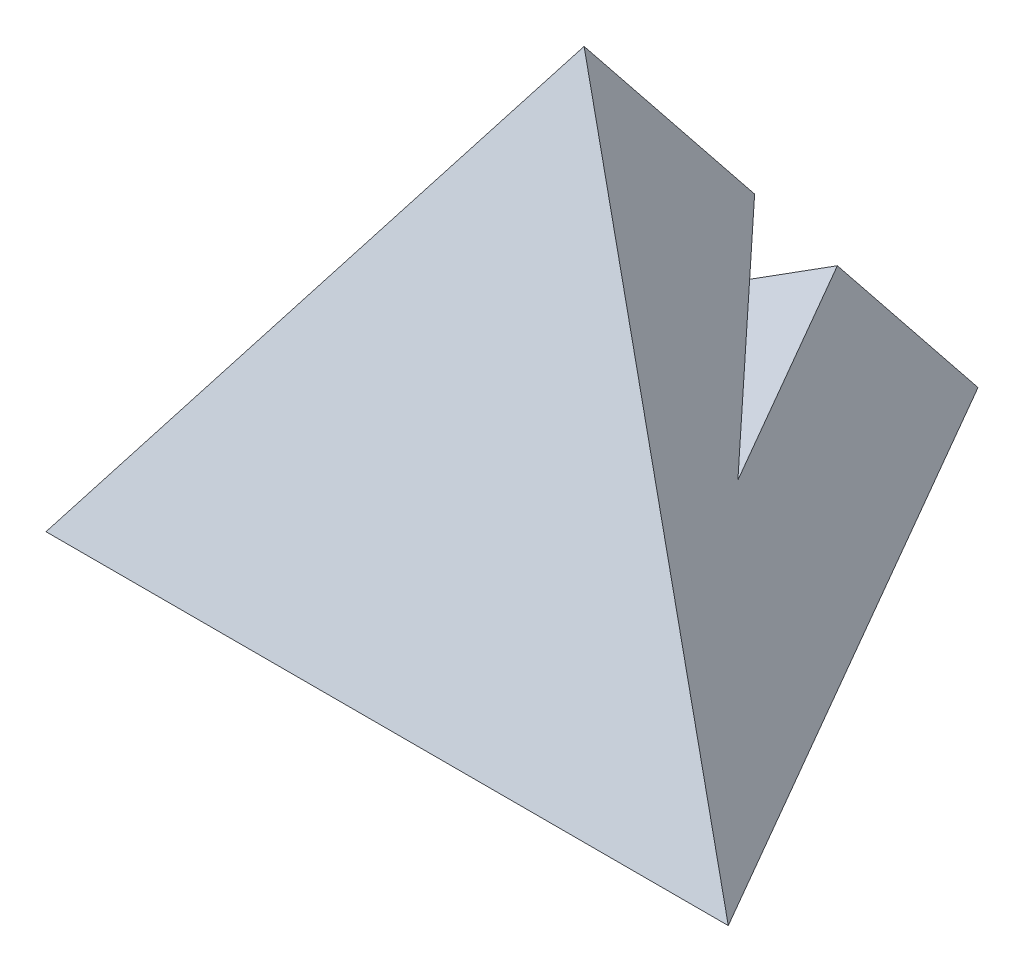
ISO-10303-21;
HEADER;
FILE_DESCRIPTION(('STEP AP214'),'2;1');
FILE_NAME('part.step','',(''),(''),'','','');
FILE_SCHEMA(('AUTOMOTIVE_DESIGN { 1 0 10303 214 1 1 1 1 }'));
ENDSEC;
DATA;
#1=APPLICATION_CONTEXT('core data for automotive mechanical design processes');
#2=APPLICATION_PROTOCOL_DEFINITION('international standard','automotive_design',2000,#1);
#3=PRODUCT_CONTEXT('',#1,'mechanical');
#4=PRODUCT('Part','Part','',(#3));
#5=PRODUCT_RELATED_PRODUCT_CATEGORY('part','',(#4));
#6=PRODUCT_DEFINITION_FORMATION('','',#4);
#7=PRODUCT_DEFINITION_CONTEXT('part definition',#1,'design');
#8=PRODUCT_DEFINITION('design','',#6,#7);
#9=PRODUCT_DEFINITION_SHAPE('','',#8);
#10=(LENGTH_UNIT() NAMED_UNIT(*) SI_UNIT(.MILLI.,.METRE.));
#11=(NAMED_UNIT(*) PLANE_ANGLE_UNIT() SI_UNIT($,.RADIAN.));
#12=(NAMED_UNIT(*) SI_UNIT($,.STERADIAN.) SOLID_ANGLE_UNIT());
#13=UNCERTAINTY_MEASURE_WITH_UNIT(LENGTH_MEASURE(1.E-05),#10,'distance_accuracy_value','');
#14=(GEOMETRIC_REPRESENTATION_CONTEXT(3) GLOBAL_UNCERTAINTY_ASSIGNED_CONTEXT((#13)) GLOBAL_UNIT_ASSIGNED_CONTEXT((#10,
#11,#12)) REPRESENTATION_CONTEXT('',''));
#15=CARTESIAN_POINT('',(0.,0.,0.));
#16=DIRECTION('',(0.,0.,1.));
#17=DIRECTION('',(1.,0.,0.));
#18=AXIS2_PLACEMENT_3D('',#15,#16,#17);
#19=CARTESIAN_POINT('',(0.,0.,0.));
#20=DIRECTION('',(0.,1.,0.));
#21=DIRECTION('',(0.,0.,1.));
#22=AXIS2_PLACEMENT_3D('',#19,#20,#21);
#23=PLANE('',#22);
#24=DIRECTION('',(-0.500000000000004,0.,-0.866025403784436));
#25=VECTOR('',#24,1.);
#26=CARTESIAN_POINT('',(1319.82271536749,0.,761.999999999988));
#27=LINE('',#26,#25);
#28=CARTESIAN_POINT('',(1319.82271536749,0.,761.999999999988));
#29=VERTEX_POINT('',#28);
#30=CARTESIAN_POINT('',(0.,0.,-1524.));
#31=VERTEX_POINT('',#30);
#32=EDGE_CURVE('E98',#29,#31,#27,.T.);
#33=ORIENTED_EDGE('',*,*,#32,.F.);
#34=DIRECTION('',(1.,0.,0.));
#35=VECTOR('',#34,1.);
#36=CARTESIAN_POINT('',(-1319.82271536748,0.,762.000000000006));
#37=LINE('',#36,#35);
#38=CARTESIAN_POINT('',(-1319.82271536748,0.,762.000000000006));
#39=VERTEX_POINT('',#38);
#40=EDGE_CURVE('E112',#39,#29,#37,.T.);
#41=ORIENTED_EDGE('',*,*,#40,.F.);
#42=DIRECTION('',(-0.499999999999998,0.,0.86602540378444));
#43=VECTOR('',#42,1.);
#44=CARTESIAN_POINT('',(0.,0.,-1524.));
#45=LINE('',#44,#43);
#46=EDGE_CURVE('E167',#31,#39,#45,.T.);
#47=ORIENTED_EDGE('',*,*,#46,.F.);
#48=EDGE_LOOP('',(#33,#41,#47));
#49=FACE_BOUND('',#48,.T.);
#50=ADVANCED_FACE('F48',(#49),#23,.F.);
#51=CARTESIAN_POINT('',(-568.889101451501,262.758620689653,-328.448275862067));
#52=DIRECTION('',(-0.804084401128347,0.371390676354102,-0.464238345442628));
#53=DIRECTION('',(-0.499999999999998,0.,0.86602540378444));
#54=AXIS2_PLACEMENT_3D('',#51,#52,#53);
#55=PLANE('',#54);
#56=DIRECTION('',(-0.499999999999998,0.,0.86602540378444));
#57=VECTOR('',#56,1.);
#58=CARTESIAN_POINT('',(-424.308091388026,680.12804608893,-244.974390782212));
#59=LINE('',#58,#57);
#60=CARTESIAN_POINT('',(0.,680.12804608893,-979.897563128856));
#61=VERTEX_POINT('',#60);
#62=CARTESIAN_POINT('',(-525.775102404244,680.12804608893,-69.2283724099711));
#63=VERTEX_POINT('',#62);
#64=EDGE_CURVE('E91',#61,#63,#59,.T.);
#65=ORIENTED_EDGE('',*,*,#64,.F.);
#66=DIRECTION('',(0.,-0.78086880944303,-0.624695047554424));
#67=VECTOR('',#66,1.);
#68=CARTESIAN_POINT('',(0.,1905.,0.));
#69=LINE('',#68,#67);
#70=EDGE_CURVE('E147',#61,#31,#69,.T.);
#71=ORIENTED_EDGE('',*,*,#70,.T.);
#72=ORIENTED_EDGE('',*,*,#46,.T.);
#73=DIRECTION('',(-0.541001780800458,-0.78086880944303,0.312347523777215));
#74=VECTOR('',#73,1.);
#75=CARTESIAN_POINT('',(0.,1905.,0.));
#76=LINE('',#75,#74);
#77=CARTESIAN_POINT('',(0.,1905.,0.));
#78=VERTEX_POINT('',#77);
#79=EDGE_CURVE('E117',#78,#39,#76,.T.);
#80=ORIENTED_EDGE('',*,*,#79,.F.);
#81=CARTESIAN_POINT('',(0.,1080.25308130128,-659.797534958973));
#82=VERTEX_POINT('',#81);
#83=EDGE_CURVE('E72',#78,#82,#69,.T.);
#84=ORIENTED_EDGE('',*,*,#83,.T.);
#85=DIRECTION('',(0.59330643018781,0.451517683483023,-0.666422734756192));
#86=VECTOR('',#85,1.);
#87=CARTESIAN_POINT('',(-550.266466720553,661.489643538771,-41.7188071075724));
#88=LINE('',#87,#86);
#89=EDGE_CURVE('E65',#63,#82,#88,.T.);
#90=ORIENTED_EDGE('',*,*,#89,.F.);
#91=EDGE_LOOP('',(#65,#71,#72,#80,#84,#90));
#92=FACE_BOUND('',#91,.T.);
#93=ADVANCED_FACE('F103',(#92),#55,.T.);
#94=CARTESIAN_POINT('',(4.55326481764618E-12,262.758620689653,656.896551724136));
#95=DIRECTION('',(0.,0.371390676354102,0.92847669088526));
#96=DIRECTION('',(0.,-0.92847669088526,0.371390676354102));
#97=AXIS2_PLACEMENT_3D('',#94,#95,#96);
#98=PLANE('',#97);
#99=ORIENTED_EDGE('',*,*,#79,.T.);
#100=ORIENTED_EDGE('',*,*,#40,.T.);
#101=DIRECTION('',(0.541001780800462,-0.78086880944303,0.312347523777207));
#102=VECTOR('',#101,1.);
#103=CARTESIAN_POINT('',(0.,1905.,0.));
#104=LINE('',#103,#102);
#105=EDGE_CURVE('E160',#78,#29,#104,.T.);
#106=ORIENTED_EDGE('',*,*,#105,.F.);
#107=EDGE_LOOP('',(#99,#100,#106));
#108=FACE_BOUND('',#107,.T.);
#109=ADVANCED_FACE('F119',(#108),#98,.T.);
#110=CARTESIAN_POINT('',(568.889101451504,262.758620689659,-328.448275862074));
#111=DIRECTION('',(0.804084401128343,0.371390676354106,-0.464238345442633));
#112=DIRECTION('',(-0.500000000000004,0.,-0.866025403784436));
#113=AXIS2_PLACEMENT_3D('',#110,#111,#112);
#114=PLANE('',#113);
#115=DIRECTION('',(-0.500000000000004,0.,-0.866025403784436));
#116=VECTOR('',#115,1.);
#117=CARTESIAN_POINT('',(424.30809138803,680.12804608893,-244.974390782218));
#118=LINE('',#117,#116);
#119=CARTESIAN_POINT('',(525.775102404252,680.12804608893,-69.2283724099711));
#120=VERTEX_POINT('',#119);
#121=EDGE_CURVE('E12',#120,#61,#118,.T.);
#122=ORIENTED_EDGE('',*,*,#121,.F.);
#123=DIRECTION('',(0.593306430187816,-0.45151768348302,0.666422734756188));
#124=VECTOR('',#123,1.);
#125=CARTESIAN_POINT('',(550.266466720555,661.489643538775,-41.7188071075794));
#126=LINE('',#125,#124);
#127=EDGE_CURVE('E58',#82,#120,#126,.T.);
#128=ORIENTED_EDGE('',*,*,#127,.F.);
#129=ORIENTED_EDGE('',*,*,#83,.F.);
#130=ORIENTED_EDGE('',*,*,#105,.T.);
#131=ORIENTED_EDGE('',*,*,#32,.T.);
#132=ORIENTED_EDGE('',*,*,#70,.F.);
#133=EDGE_LOOP('',(#122,#128,#129,#130,#131,#132));
#134=FACE_BOUND('',#133,.T.);
#135=ADVANCED_FACE('F50',(#134),#114,.T.);
#136=CARTESIAN_POINT('',(-1319.82281536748,680.12804608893,-69.2283724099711));
#137=DIRECTION('',(0.,-1.,0.));
#138=DIRECTION('',(0.,0.,-1.));
#139=AXIS2_PLACEMENT_3D('',#136,#137,#138);
#140=PLANE('',#139);
#141=ORIENTED_EDGE('',*,*,#64,.T.);
#142=DIRECTION('',(1.,0.,0.));
#143=VECTOR('',#142,1.);
#144=CARTESIAN_POINT('',(-1319.82281536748,680.12804608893,-69.2283724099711));
#145=LINE('',#144,#143);
#146=EDGE_CURVE('E93',#63,#120,#145,.T.);
#147=ORIENTED_EDGE('',*,*,#146,.T.);
#148=ORIENTED_EDGE('',*,*,#121,.T.);
#149=EDGE_LOOP('',(#141,#147,#148));
#150=FACE_BOUND('',#149,.T.);
#151=ADVANCED_FACE('F92',(#150),#140,.F.);
#152=CARTESIAN_POINT('',(-1319.82281536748,680.12804608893,-69.2283724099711));
#153=DIRECTION('',(0.,0.827878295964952,0.560907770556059));
#154=DIRECTION('',(0.,-0.560907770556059,0.827878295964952));
#155=AXIS2_PLACEMENT_3D('',#152,#153,#154);
#156=PLANE('',#155);
#157=ORIENTED_EDGE('',*,*,#89,.T.);
#158=ORIENTED_EDGE('',*,*,#127,.T.);
#159=ORIENTED_EDGE('',*,*,#146,.F.);
#160=EDGE_LOOP('',(#157,#158,#159));
#161=FACE_BOUND('',#160,.T.);
#162=ADVANCED_FACE('F100',(#161),#156,.F.);
#163=CLOSED_SHELL('',(#50,#93,#109,#135,#151,#162));
#164=MANIFOLD_SOLID_BREP('B2',#163);
#165=ADVANCED_BREP_SHAPE_REPRESENTATION('',(#18,#164),#14);
#166=SHAPE_DEFINITION_REPRESENTATION(#9,#165);
ENDSEC;
END-ISO-10303-21;
